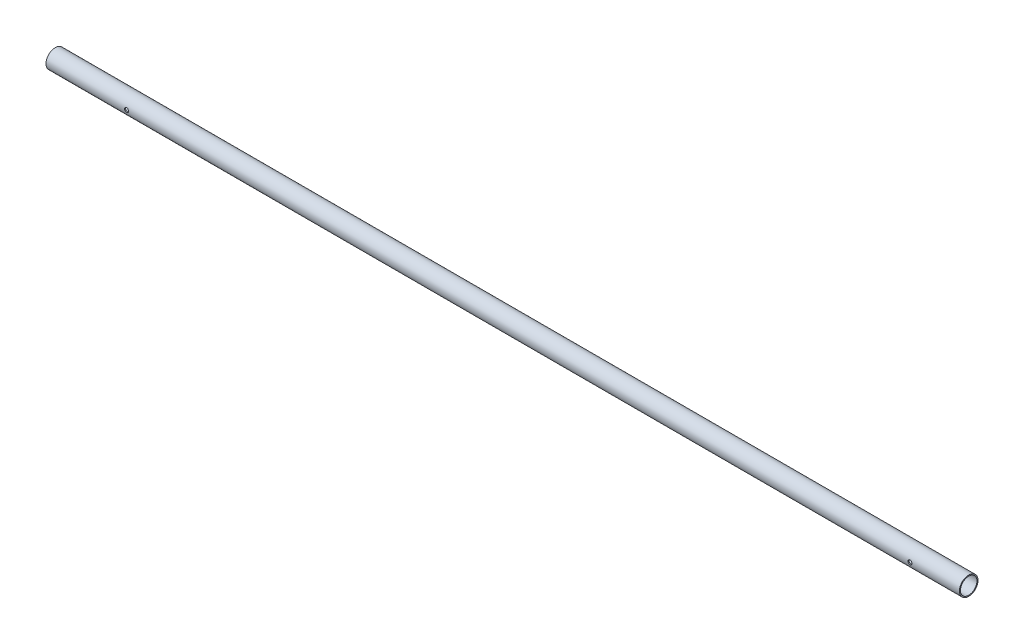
from build123d import *

# Parameters (mm, degrees)
SKETCH1_R           = 19.05
SKETCH1_R_2         = 16.9418
EXTRUDE1_DEPTH      = 936.625
EXTRUDE2_DEPTH      = 938.01237752
EXTRUDE2_DEPTH_BACK = 938.01237752
SKETCH2_R           = 4.1656


with BuildPart() as part:
    # Sketch1 → Extrude1 (new, symmetric)
    with BuildSketch(Plane(origin=(0, 0, 0), x_dir=(0, 0, -1), z_dir=(1, 0, 0))):
        Circle(SKETCH1_R)
        Circle(SKETCH1_R_2, mode=Mode.SUBTRACT)
    extrude(amount=EXTRUDE1_DEPTH, both=True)

    # Sketch2 → Extrude2 (cut, two sides: drawn at the far end of the back side and taken through both)
    with BuildSketch(Plane.XY.offset(-EXTRUDE2_DEPTH_BACK)):
        with Locations((-771.525, 0)):
            Circle(SKETCH2_R)
        with Locations((835.025, 0)):
            Circle(SKETCH2_R)
    extrude(amount=EXTRUDE2_DEPTH + EXTRUDE2_DEPTH_BACK, mode=Mode.SUBTRACT)


solid = part.part
